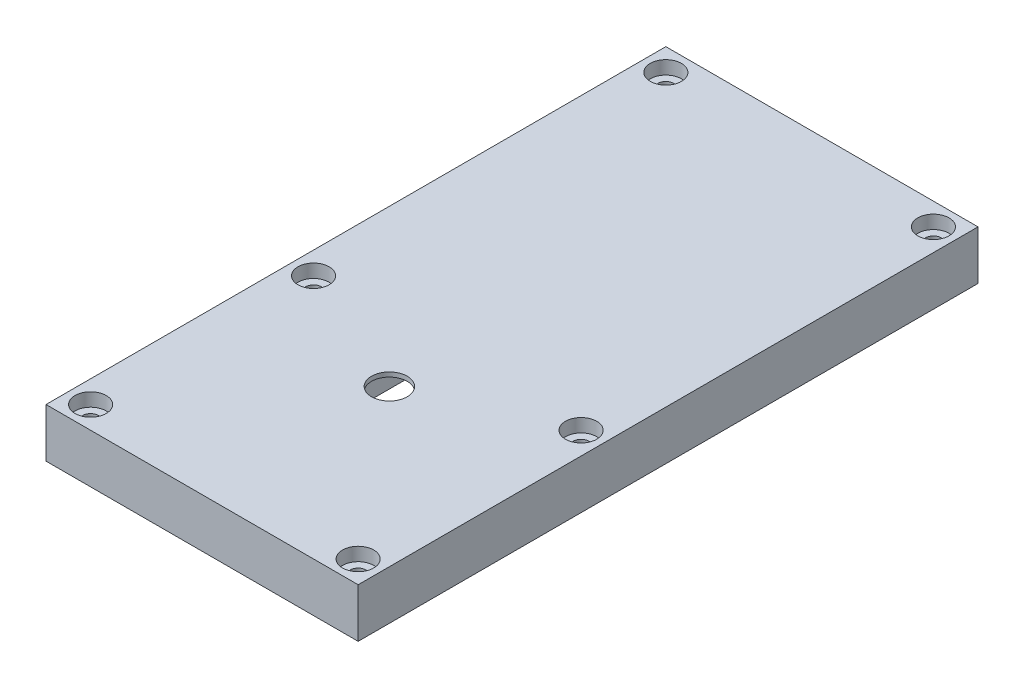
ISO-10303-21;
HEADER;
FILE_DESCRIPTION(('STEP AP214'),'2;1');
FILE_NAME('part.step','',(''),(''),'','','');
FILE_SCHEMA(('AUTOMOTIVE_DESIGN { 1 0 10303 214 1 1 1 1 }'));
ENDSEC;
DATA;
#1=APPLICATION_CONTEXT('core data for automotive mechanical design processes');
#2=APPLICATION_PROTOCOL_DEFINITION('international standard','automotive_design',2000,#1);
#3=PRODUCT_CONTEXT('',#1,'mechanical');
#4=PRODUCT('Part','Part','',(#3));
#5=PRODUCT_RELATED_PRODUCT_CATEGORY('part','',(#4));
#6=PRODUCT_DEFINITION_FORMATION('','',#4);
#7=PRODUCT_DEFINITION_CONTEXT('part definition',#1,'design');
#8=PRODUCT_DEFINITION('design','',#6,#7);
#9=PRODUCT_DEFINITION_SHAPE('','',#8);
#10=(LENGTH_UNIT() NAMED_UNIT(*) SI_UNIT(.MILLI.,.METRE.));
#11=(NAMED_UNIT(*) PLANE_ANGLE_UNIT() SI_UNIT($,.RADIAN.));
#12=(NAMED_UNIT(*) SI_UNIT($,.STERADIAN.) SOLID_ANGLE_UNIT());
#13=UNCERTAINTY_MEASURE_WITH_UNIT(LENGTH_MEASURE(1.E-05),#10,'distance_accuracy_value','');
#14=(GEOMETRIC_REPRESENTATION_CONTEXT(3) GLOBAL_UNCERTAINTY_ASSIGNED_CONTEXT((#13)) GLOBAL_UNIT_ASSIGNED_CONTEXT((#10,
#11,#12)) REPRESENTATION_CONTEXT('',''));
#15=CARTESIAN_POINT('',(0.,0.,0.));
#16=DIRECTION('',(0.,0.,1.));
#17=DIRECTION('',(1.,0.,0.));
#18=AXIS2_PLACEMENT_3D('',#15,#16,#17);
#19=CARTESIAN_POINT('',(-30.,0.,-64.5));
#20=DIRECTION('',(0.,1.,0.));
#21=DIRECTION('',(0.,0.,1.));
#22=AXIS2_PLACEMENT_3D('',#19,#20,#21);
#23=CYLINDRICAL_SURFACE('',#22,1.75);
#24=CARTESIAN_POINT('',(-30.,0.,-64.5));
#25=DIRECTION('',(0.,1.,0.));
#26=DIRECTION('',(0.,0.,1.));
#27=AXIS2_PLACEMENT_3D('',#24,#25,#26);
#28=CIRCLE('',#27,1.75);
#29=CARTESIAN_POINT('',(-30.,0.,-62.75));
#30=VERTEX_POINT('',#29);
#31=EDGE_CURVE('E211',#30,#30,#28,.T.);
#32=ORIENTED_EDGE('',*,*,#31,.F.);
#33=EDGE_LOOP('',(#32));
#34=FACE_BOUND('',#33,.T.);
#35=CARTESIAN_POINT('',(-30.,8.,-64.5));
#36=DIRECTION('',(0.,1.,0.));
#37=DIRECTION('',(0.,0.,1.));
#38=AXIS2_PLACEMENT_3D('',#35,#36,#37);
#39=CIRCLE('',#38,1.75);
#40=CARTESIAN_POINT('',(-30.,8.,-62.75));
#41=VERTEX_POINT('',#40);
#42=EDGE_CURVE('E39',#41,#41,#39,.F.);
#43=ORIENTED_EDGE('',*,*,#42,.F.);
#44=EDGE_LOOP('',(#43));
#45=FACE_BOUND('',#44,.T.);
#46=ADVANCED_FACE('F35',(#34,#45),#23,.F.);
#47=CARTESIAN_POINT('',(-30.,0.,64.5));
#48=DIRECTION('',(0.,1.,0.));
#49=DIRECTION('',(0.,0.,1.));
#50=AXIS2_PLACEMENT_3D('',#47,#48,#49);
#51=CYLINDRICAL_SURFACE('',#50,1.75);
#52=CARTESIAN_POINT('',(-30.,0.,64.5));
#53=DIRECTION('',(0.,1.,0.));
#54=DIRECTION('',(0.,0.,1.));
#55=AXIS2_PLACEMENT_3D('',#52,#53,#54);
#56=CIRCLE('',#55,1.75);
#57=CARTESIAN_POINT('',(-30.,0.,66.25));
#58=VERTEX_POINT('',#57);
#59=EDGE_CURVE('E198',#58,#58,#56,.T.);
#60=ORIENTED_EDGE('',*,*,#59,.F.);
#61=EDGE_LOOP('',(#60));
#62=FACE_BOUND('',#61,.T.);
#63=CARTESIAN_POINT('',(-30.,8.,64.5));
#64=DIRECTION('',(0.,1.,0.));
#65=DIRECTION('',(0.,0.,1.));
#66=AXIS2_PLACEMENT_3D('',#63,#64,#65);
#67=CIRCLE('',#66,1.75);
#68=CARTESIAN_POINT('',(-30.,8.,66.25));
#69=VERTEX_POINT('',#68);
#70=EDGE_CURVE('E260',#69,#69,#67,.F.);
#71=ORIENTED_EDGE('',*,*,#70,.F.);
#72=EDGE_LOOP('',(#71));
#73=FACE_BOUND('',#72,.T.);
#74=ADVANCED_FACE('F270',(#62,#73),#51,.F.);
#75=CARTESIAN_POINT('',(30.,0.,-64.5));
#76=DIRECTION('',(0.,1.,0.));
#77=DIRECTION('',(0.,0.,1.));
#78=AXIS2_PLACEMENT_3D('',#75,#76,#77);
#79=CYLINDRICAL_SURFACE('',#78,1.75);
#80=CARTESIAN_POINT('',(30.,0.,-64.5));
#81=DIRECTION('',(0.,1.,0.));
#82=DIRECTION('',(0.,0.,1.));
#83=AXIS2_PLACEMENT_3D('',#80,#81,#82);
#84=CIRCLE('',#83,1.75);
#85=CARTESIAN_POINT('',(30.,0.,-62.75));
#86=VERTEX_POINT('',#85);
#87=EDGE_CURVE('E208',#86,#86,#84,.T.);
#88=ORIENTED_EDGE('',*,*,#87,.F.);
#89=EDGE_LOOP('',(#88));
#90=FACE_BOUND('',#89,.T.);
#91=CARTESIAN_POINT('',(30.,8.,-64.5));
#92=DIRECTION('',(0.,1.,0.));
#93=DIRECTION('',(0.,0.,1.));
#94=AXIS2_PLACEMENT_3D('',#91,#92,#93);
#95=CIRCLE('',#94,1.75);
#96=CARTESIAN_POINT('',(30.,8.,-62.75));
#97=VERTEX_POINT('',#96);
#98=EDGE_CURVE('E258',#97,#97,#95,.F.);
#99=ORIENTED_EDGE('',*,*,#98,.F.);
#100=EDGE_LOOP('',(#99));
#101=FACE_BOUND('',#100,.T.);
#102=ADVANCED_FACE('F276',(#90,#101),#79,.F.);
#103=CARTESIAN_POINT('',(-30.,0.,14.5));
#104=DIRECTION('',(0.,1.,0.));
#105=DIRECTION('',(0.,0.,1.));
#106=AXIS2_PLACEMENT_3D('',#103,#104,#105);
#107=CYLINDRICAL_SURFACE('',#106,1.75000000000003);
#108=CARTESIAN_POINT('',(-30.,0.,14.5));
#109=DIRECTION('',(0.,1.,0.));
#110=DIRECTION('',(0.,0.,1.));
#111=AXIS2_PLACEMENT_3D('',#108,#109,#110);
#112=CIRCLE('',#111,1.75000000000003);
#113=CARTESIAN_POINT('',(-30.,0.,16.2500000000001));
#114=VERTEX_POINT('',#113);
#115=EDGE_CURVE('E205',#114,#114,#112,.T.);
#116=ORIENTED_EDGE('',*,*,#115,.F.);
#117=EDGE_LOOP('',(#116));
#118=FACE_BOUND('',#117,.T.);
#119=CARTESIAN_POINT('',(-30.,8.,14.5));
#120=DIRECTION('',(0.,1.,0.));
#121=DIRECTION('',(0.,0.,1.));
#122=AXIS2_PLACEMENT_3D('',#119,#120,#121);
#123=CIRCLE('',#122,1.75000000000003);
#124=CARTESIAN_POINT('',(-30.,8.,16.2500000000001));
#125=VERTEX_POINT('',#124);
#126=EDGE_CURVE('E255',#125,#125,#123,.F.);
#127=ORIENTED_EDGE('',*,*,#126,.F.);
#128=EDGE_LOOP('',(#127));
#129=FACE_BOUND('',#128,.T.);
#130=ADVANCED_FACE('F282',(#118,#129),#107,.F.);
#131=CARTESIAN_POINT('',(30.,0.,14.5));
#132=DIRECTION('',(0.,1.,0.));
#133=DIRECTION('',(0.,0.,1.));
#134=AXIS2_PLACEMENT_3D('',#131,#132,#133);
#135=CYLINDRICAL_SURFACE('',#134,1.75000000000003);
#136=CARTESIAN_POINT('',(30.,0.,14.5));
#137=DIRECTION('',(0.,1.,0.));
#138=DIRECTION('',(0.,0.,1.));
#139=AXIS2_PLACEMENT_3D('',#136,#137,#138);
#140=CIRCLE('',#139,1.75000000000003);
#141=CARTESIAN_POINT('',(30.,0.,16.2500000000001));
#142=VERTEX_POINT('',#141);
#143=EDGE_CURVE('E202',#142,#142,#140,.T.);
#144=ORIENTED_EDGE('',*,*,#143,.F.);
#145=EDGE_LOOP('',(#144));
#146=FACE_BOUND('',#145,.T.);
#147=CARTESIAN_POINT('',(30.,8.,14.5));
#148=DIRECTION('',(0.,1.,0.));
#149=DIRECTION('',(0.,0.,1.));
#150=AXIS2_PLACEMENT_3D('',#147,#148,#149);
#151=CIRCLE('',#150,1.75000000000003);
#152=CARTESIAN_POINT('',(30.,8.,16.2500000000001));
#153=VERTEX_POINT('',#152);
#154=EDGE_CURVE('E251',#153,#153,#151,.F.);
#155=ORIENTED_EDGE('',*,*,#154,.F.);
#156=EDGE_LOOP('',(#155));
#157=FACE_BOUND('',#156,.T.);
#158=ADVANCED_FACE('F355',(#146,#157),#135,.F.);
#159=CARTESIAN_POINT('',(30.,0.,64.5));
#160=DIRECTION('',(0.,1.,0.));
#161=DIRECTION('',(0.,0.,1.));
#162=AXIS2_PLACEMENT_3D('',#159,#160,#161);
#163=CYLINDRICAL_SURFACE('',#162,1.75);
#164=CARTESIAN_POINT('',(30.,0.,64.5));
#165=DIRECTION('',(0.,1.,0.));
#166=DIRECTION('',(0.,0.,1.));
#167=AXIS2_PLACEMENT_3D('',#164,#165,#166);
#168=CIRCLE('',#167,1.75);
#169=CARTESIAN_POINT('',(30.,0.,66.25));
#170=VERTEX_POINT('',#169);
#171=EDGE_CURVE('E201',#170,#170,#168,.T.);
#172=ORIENTED_EDGE('',*,*,#171,.F.);
#173=EDGE_LOOP('',(#172));
#174=FACE_BOUND('',#173,.T.);
#175=CARTESIAN_POINT('',(30.,8.,64.5));
#176=DIRECTION('',(0.,1.,0.));
#177=DIRECTION('',(0.,0.,1.));
#178=AXIS2_PLACEMENT_3D('',#175,#176,#177);
#179=CIRCLE('',#178,1.75);
#180=CARTESIAN_POINT('',(30.,8.,66.25));
#181=VERTEX_POINT('',#180);
#182=EDGE_CURVE('E248',#181,#181,#179,.F.);
#183=ORIENTED_EDGE('',*,*,#182,.F.);
#184=EDGE_LOOP('',(#183));
#185=FACE_BOUND('',#184,.T.);
#186=ADVANCED_FACE('F309',(#174,#185),#163,.F.);
#187=CARTESIAN_POINT('',(35.,11.,69.5));
#188=DIRECTION('',(-1.,0.,0.));
#189=DIRECTION('',(0.,0.,1.));
#190=AXIS2_PLACEMENT_3D('',#187,#188,#189);
#191=PLANE('',#190);
#192=DIRECTION('',(0.,0.,-1.));
#193=VECTOR('',#192,1.);
#194=CARTESIAN_POINT('',(35.,0.,69.5));
#195=LINE('',#194,#193);
#196=CARTESIAN_POINT('',(35.,0.,69.5));
#197=VERTEX_POINT('',#196);
#198=CARTESIAN_POINT('',(35.,0.,-69.5));
#199=VERTEX_POINT('',#198);
#200=EDGE_CURVE('E219',#197,#199,#195,.T.);
#201=ORIENTED_EDGE('',*,*,#200,.T.);
#202=DIRECTION('',(0.,-1.,0.));
#203=VECTOR('',#202,1.);
#204=CARTESIAN_POINT('',(35.,11.,-69.5));
#205=LINE('',#204,#203);
#206=CARTESIAN_POINT('',(35.,11.,-69.5));
#207=VERTEX_POINT('',#206);
#208=EDGE_CURVE('E11',#207,#199,#205,.T.);
#209=ORIENTED_EDGE('',*,*,#208,.F.);
#210=DIRECTION('',(0.,0.,-1.));
#211=VECTOR('',#210,1.);
#212=CARTESIAN_POINT('',(35.,11.,69.5));
#213=LINE('',#212,#211);
#214=CARTESIAN_POINT('',(35.,11.,69.5));
#215=VERTEX_POINT('',#214);
#216=EDGE_CURVE('E220',#215,#207,#213,.T.);
#217=ORIENTED_EDGE('',*,*,#216,.F.);
#218=DIRECTION('',(0.,-1.,0.));
#219=VECTOR('',#218,1.);
#220=CARTESIAN_POINT('',(35.,11.,69.5));
#221=LINE('',#220,#219);
#222=EDGE_CURVE('E230',#215,#197,#221,.T.);
#223=ORIENTED_EDGE('',*,*,#222,.T.);
#224=EDGE_LOOP('',(#201,#209,#217,#223));
#225=FACE_BOUND('',#224,.T.);
#226=ADVANCED_FACE('F37',(#225),#191,.F.);
#227=CARTESIAN_POINT('',(-35.,11.,-69.5));
#228=DIRECTION('',(0.,0.,1.));
#229=DIRECTION('',(1.,0.,0.));
#230=AXIS2_PLACEMENT_3D('',#227,#228,#229);
#231=PLANE('',#230);
#232=DIRECTION('',(-1.,0.,0.));
#233=VECTOR('',#232,1.);
#234=CARTESIAN_POINT('',(-35.,0.,-69.5));
#235=LINE('',#234,#233);
#236=CARTESIAN_POINT('',(10.25,0.,-69.5));
#237=VERTEX_POINT('',#236);
#238=EDGE_CURVE('E233',#199,#237,#235,.T.);
#239=ORIENTED_EDGE('',*,*,#238,.T.);
#240=DIRECTION('',(0.,1.,0.));
#241=VECTOR('',#240,1.);
#242=CARTESIAN_POINT('',(10.25,-12.75,-69.5));
#243=LINE('',#242,#241);
#244=CARTESIAN_POINT('',(10.25,-12.75,-69.5));
#245=VERTEX_POINT('',#244);
#246=EDGE_CURVE('E193',#245,#237,#243,.T.);
#247=ORIENTED_EDGE('',*,*,#246,.F.);
#248=DIRECTION('',(1.,0.,0.));
#249=VECTOR('',#248,1.);
#250=CARTESIAN_POINT('',(-10.25,-12.75,-69.5));
#251=LINE('',#250,#249);
#252=CARTESIAN_POINT('',(-10.25,-12.75,-69.5));
#253=VERTEX_POINT('',#252);
#254=EDGE_CURVE('E176',#253,#245,#251,.T.);
#255=ORIENTED_EDGE('',*,*,#254,.F.);
#256=DIRECTION('',(0.,1.,0.));
#257=VECTOR('',#256,1.);
#258=CARTESIAN_POINT('',(-10.25,-12.75,-69.5));
#259=LINE('',#258,#257);
#260=CARTESIAN_POINT('',(-10.25,0.,-69.5));
#261=VERTEX_POINT('',#260);
#262=EDGE_CURVE('E196',#253,#261,#259,.T.);
#263=ORIENTED_EDGE('',*,*,#262,.T.);
#264=CARTESIAN_POINT('',(-35.,0.,-69.5));
#265=VERTEX_POINT('',#264);
#266=EDGE_CURVE('E59',#261,#265,#235,.T.);
#267=ORIENTED_EDGE('',*,*,#266,.T.);
#268=DIRECTION('',(0.,-1.,0.));
#269=VECTOR('',#268,1.);
#270=CARTESIAN_POINT('',(-35.,11.,-69.5));
#271=LINE('',#270,#269);
#272=CARTESIAN_POINT('',(-35.,11.,-69.5));
#273=VERTEX_POINT('',#272);
#274=EDGE_CURVE('E44',#273,#265,#271,.T.);
#275=ORIENTED_EDGE('',*,*,#274,.F.);
#276=DIRECTION('',(-1.,0.,0.));
#277=VECTOR('',#276,1.);
#278=CARTESIAN_POINT('',(-35.,11.,-69.5));
#279=LINE('',#278,#277);
#280=EDGE_CURVE('E223',#207,#273,#279,.T.);
#281=ORIENTED_EDGE('',*,*,#280,.F.);
#282=ORIENTED_EDGE('',*,*,#208,.T.);
#283=EDGE_LOOP('',(#239,#247,#255,#263,#267,#275,#281,#282));
#284=FACE_BOUND('',#283,.T.);
#285=ADVANCED_FACE('F302',(#284),#231,.F.);
#286=CARTESIAN_POINT('',(-35.,11.,69.5));
#287=DIRECTION('',(1.,0.,0.));
#288=DIRECTION('',(0.,0.,-1.));
#289=AXIS2_PLACEMENT_3D('',#286,#287,#288);
#290=PLANE('',#289);
#291=DIRECTION('',(0.,0.,1.));
#292=VECTOR('',#291,1.);
#293=CARTESIAN_POINT('',(-35.,0.,69.5));
#294=LINE('',#293,#292);
#295=CARTESIAN_POINT('',(-35.,0.,69.5));
#296=VERTEX_POINT('',#295);
#297=EDGE_CURVE('E236',#265,#296,#294,.T.);
#298=ORIENTED_EDGE('',*,*,#297,.T.);
#299=DIRECTION('',(0.,-1.,0.));
#300=VECTOR('',#299,1.);
#301=CARTESIAN_POINT('',(-35.,11.,69.5));
#302=LINE('',#301,#300);
#303=CARTESIAN_POINT('',(-35.,11.,69.5));
#304=VERTEX_POINT('',#303);
#305=EDGE_CURVE('E241',#304,#296,#302,.T.);
#306=ORIENTED_EDGE('',*,*,#305,.F.);
#307=DIRECTION('',(0.,0.,1.));
#308=VECTOR('',#307,1.);
#309=CARTESIAN_POINT('',(-35.,11.,69.5));
#310=LINE('',#309,#308);
#311=EDGE_CURVE('E226',#273,#304,#310,.T.);
#312=ORIENTED_EDGE('',*,*,#311,.F.);
#313=ORIENTED_EDGE('',*,*,#274,.T.);
#314=EDGE_LOOP('',(#298,#306,#312,#313));
#315=FACE_BOUND('',#314,.T.);
#316=ADVANCED_FACE('F299',(#315),#290,.F.);
#317=CARTESIAN_POINT('',(-35.,11.,69.5));
#318=DIRECTION('',(0.,0.,-1.));
#319=DIRECTION('',(-1.,0.,0.));
#320=AXIS2_PLACEMENT_3D('',#317,#318,#319);
#321=PLANE('',#320);
#322=DIRECTION('',(1.,0.,0.));
#323=VECTOR('',#322,1.);
#324=CARTESIAN_POINT('',(-35.,0.,69.5));
#325=LINE('',#324,#323);
#326=EDGE_CURVE('E224',#296,#197,#325,.T.);
#327=ORIENTED_EDGE('',*,*,#326,.T.);
#328=ORIENTED_EDGE('',*,*,#222,.F.);
#329=DIRECTION('',(1.,0.,0.));
#330=VECTOR('',#329,1.);
#331=CARTESIAN_POINT('',(-35.,11.,69.5));
#332=LINE('',#331,#330);
#333=EDGE_CURVE('E228',#304,#215,#332,.T.);
#334=ORIENTED_EDGE('',*,*,#333,.F.);
#335=ORIENTED_EDGE('',*,*,#305,.T.);
#336=EDGE_LOOP('',(#327,#328,#334,#335));
#337=FACE_BOUND('',#336,.T.);
#338=ADVANCED_FACE('F293',(#337),#321,.F.);
#339=CARTESIAN_POINT('',(0.,11.,0.));
#340=DIRECTION('',(0.,-1.,0.));
#341=DIRECTION('',(0.,0.,-1.));
#342=AXIS2_PLACEMENT_3D('',#339,#340,#341);
#343=PLANE('',#342);
#344=CARTESIAN_POINT('',(-30.,11.,64.5));
#345=DIRECTION('',(0.,1.,0.));
#346=DIRECTION('',(0.,0.,1.));
#347=AXIS2_PLACEMENT_3D('',#344,#345,#346);
#348=CIRCLE('',#347,3.5);
#349=CARTESIAN_POINT('',(-30.,11.,68.));
#350=VERTEX_POINT('',#349);
#351=EDGE_CURVE('E554',#350,#350,#348,.T.);
#352=ORIENTED_EDGE('',*,*,#351,.F.);
#353=EDGE_LOOP('',(#352));
#354=FACE_BOUND('',#353,.T.);
#355=CARTESIAN_POINT('',(30.,11.,14.5));
#356=DIRECTION('',(0.,1.,0.));
#357=DIRECTION('',(0.,0.,1.));
#358=AXIS2_PLACEMENT_3D('',#355,#356,#357);
#359=CIRCLE('',#358,3.5);
#360=CARTESIAN_POINT('',(30.,11.,18.));
#361=VERTEX_POINT('',#360);
#362=EDGE_CURVE('E557',#361,#361,#359,.T.);
#363=ORIENTED_EDGE('',*,*,#362,.F.);
#364=EDGE_LOOP('',(#363));
#365=FACE_BOUND('',#364,.T.);
#366=CARTESIAN_POINT('',(-30.,11.,14.5));
#367=DIRECTION('',(0.,1.,0.));
#368=DIRECTION('',(0.,0.,1.));
#369=AXIS2_PLACEMENT_3D('',#366,#367,#368);
#370=CIRCLE('',#369,3.5);
#371=CARTESIAN_POINT('',(-30.,11.,18.));
#372=VERTEX_POINT('',#371);
#373=EDGE_CURVE('E572',#372,#372,#370,.T.);
#374=ORIENTED_EDGE('',*,*,#373,.F.);
#375=EDGE_LOOP('',(#374));
#376=FACE_BOUND('',#375,.T.);
#377=CARTESIAN_POINT('',(30.,11.,-64.5));
#378=DIRECTION('',(0.,1.,0.));
#379=DIRECTION('',(0.,0.,1.));
#380=AXIS2_PLACEMENT_3D('',#377,#378,#379);
#381=CIRCLE('',#380,3.5);
#382=CARTESIAN_POINT('',(30.,11.,-61.));
#383=VERTEX_POINT('',#382);
#384=EDGE_CURVE('E566',#383,#383,#381,.T.);
#385=ORIENTED_EDGE('',*,*,#384,.F.);
#386=EDGE_LOOP('',(#385));
#387=FACE_BOUND('',#386,.T.);
#388=CARTESIAN_POINT('',(30.,11.,64.5));
#389=DIRECTION('',(0.,1.,0.));
#390=DIRECTION('',(0.,0.,1.));
#391=AXIS2_PLACEMENT_3D('',#388,#389,#390);
#392=CIRCLE('',#391,3.5);
#393=CARTESIAN_POINT('',(30.,11.,68.));
#394=VERTEX_POINT('',#393);
#395=EDGE_CURVE('E560',#394,#394,#392,.T.);
#396=ORIENTED_EDGE('',*,*,#395,.F.);
#397=EDGE_LOOP('',(#396));
#398=FACE_BOUND('',#397,.T.);
#399=CARTESIAN_POINT('',(-30.,11.,-64.5));
#400=DIRECTION('',(0.,1.,0.));
#401=DIRECTION('',(0.,0.,1.));
#402=AXIS2_PLACEMENT_3D('',#399,#400,#401);
#403=CIRCLE('',#402,3.5);
#404=CARTESIAN_POINT('',(-30.,11.,-61.));
#405=VERTEX_POINT('',#404);
#406=EDGE_CURVE('E157',#405,#405,#403,.T.);
#407=ORIENTED_EDGE('',*,*,#406,.F.);
#408=EDGE_LOOP('',(#407));
#409=FACE_BOUND('',#408,.T.);
#410=CARTESIAN_POINT('',(0.,11.,27.5));
#411=DIRECTION('',(0.,1.,0.));
#412=DIRECTION('',(0.,0.,1.));
#413=AXIS2_PLACEMENT_3D('',#410,#411,#412);
#414=CIRCLE('',#413,4.);
#415=CARTESIAN_POINT('',(0.,11.,31.5));
#416=VERTEX_POINT('',#415);
#417=EDGE_CURVE('E216',#416,#416,#414,.T.);
#418=ORIENTED_EDGE('',*,*,#417,.F.);
#419=EDGE_LOOP('',(#418));
#420=FACE_BOUND('',#419,.T.);
#421=ORIENTED_EDGE('',*,*,#216,.T.);
#422=ORIENTED_EDGE('',*,*,#280,.T.);
#423=ORIENTED_EDGE('',*,*,#311,.T.);
#424=ORIENTED_EDGE('',*,*,#333,.T.);
#425=EDGE_LOOP('',(#421,#422,#423,#424));
#426=FACE_BOUND('',#425,.T.);
#427=ADVANCED_FACE('F290',(#354,#365,#376,#387,#398,#409,#420,#426),#343,.F.);
#428=CARTESIAN_POINT('',(0.,0.,0.));
#429=DIRECTION('',(0.,-1.,0.));
#430=DIRECTION('',(0.,0.,-1.));
#431=AXIS2_PLACEMENT_3D('',#428,#429,#430);
#432=PLANE('',#431);
#433=DIRECTION('',(1.,0.,0.));
#434=VECTOR('',#433,1.);
#435=CARTESIAN_POINT('',(-10.5,0.,-65.5));
#436=LINE('',#435,#434);
#437=CARTESIAN_POINT('',(-10.5,0.,-65.5));
#438=VERTEX_POINT('',#437);
#439=CARTESIAN_POINT('',(-10.25,0.,-65.5));
#440=VERTEX_POINT('',#439);
#441=EDGE_CURVE('E52',#438,#440,#436,.T.);
#442=ORIENTED_EDGE('',*,*,#441,.F.);
#443=DIRECTION('',(0.,0.,-1.));
#444=VECTOR('',#443,1.);
#445=CARTESIAN_POINT('',(-10.5,0.,-65.5));
#446=LINE('',#445,#444);
#447=CARTESIAN_POINT('',(-10.5,0.,37.5));
#448=VERTEX_POINT('',#447);
#449=EDGE_CURVE('E134',#448,#438,#446,.T.);
#450=ORIENTED_EDGE('',*,*,#449,.F.);
#451=DIRECTION('',(-1.,0.,0.));
#452=VECTOR('',#451,1.);
#453=CARTESIAN_POINT('',(-10.5,0.,37.5));
#454=LINE('',#453,#452);
#455=CARTESIAN_POINT('',(10.5,0.,37.5));
#456=VERTEX_POINT('',#455);
#457=EDGE_CURVE('E151',#456,#448,#454,.T.);
#458=ORIENTED_EDGE('',*,*,#457,.F.);
#459=DIRECTION('',(0.,0.,1.));
#460=VECTOR('',#459,1.);
#461=CARTESIAN_POINT('',(10.5,0.,37.5));
#462=LINE('',#461,#460);
#463=CARTESIAN_POINT('',(10.5,0.,-65.5));
#464=VERTEX_POINT('',#463);
#465=EDGE_CURVE('E154',#464,#456,#462,.T.);
#466=ORIENTED_EDGE('',*,*,#465,.F.);
#467=CARTESIAN_POINT('',(10.25,0.,-65.5));
#468=VERTEX_POINT('',#467);
#469=EDGE_CURVE('E163',#468,#464,#436,.T.);
#470=ORIENTED_EDGE('',*,*,#469,.F.);
#471=DIRECTION('',(0.,0.,1.));
#472=VECTOR('',#471,1.);
#473=CARTESIAN_POINT('',(10.25,0.,-65.5));
#474=LINE('',#473,#472);
#475=EDGE_CURVE('E177',#237,#468,#474,.T.);
#476=ORIENTED_EDGE('',*,*,#475,.F.);
#477=ORIENTED_EDGE('',*,*,#238,.F.);
#478=ORIENTED_EDGE('',*,*,#200,.F.);
#479=ORIENTED_EDGE('',*,*,#326,.F.);
#480=ORIENTED_EDGE('',*,*,#297,.F.);
#481=ORIENTED_EDGE('',*,*,#266,.F.);
#482=DIRECTION('',(0.,0.,-1.));
#483=VECTOR('',#482,1.);
#484=CARTESIAN_POINT('',(-10.25,0.,-65.5));
#485=LINE('',#484,#483);
#486=EDGE_CURVE('E184',#440,#261,#485,.T.);
#487=ORIENTED_EDGE('',*,*,#486,.F.);
#488=EDGE_LOOP('',(#442,#450,#458,#466,#470,#476,#477,#478,#479,#480,#481,#487));
#489=FACE_BOUND('',#488,.T.);
#490=ORIENTED_EDGE('',*,*,#171,.T.);
#491=EDGE_LOOP('',(#490));
#492=FACE_BOUND('',#491,.T.);
#493=ORIENTED_EDGE('',*,*,#143,.T.);
#494=EDGE_LOOP('',(#493));
#495=FACE_BOUND('',#494,.T.);
#496=ORIENTED_EDGE('',*,*,#115,.T.);
#497=EDGE_LOOP('',(#496));
#498=FACE_BOUND('',#497,.T.);
#499=ORIENTED_EDGE('',*,*,#87,.T.);
#500=EDGE_LOOP('',(#499));
#501=FACE_BOUND('',#500,.T.);
#502=ORIENTED_EDGE('',*,*,#59,.T.);
#503=EDGE_LOOP('',(#502));
#504=FACE_BOUND('',#503,.T.);
#505=ORIENTED_EDGE('',*,*,#31,.T.);
#506=EDGE_LOOP('',(#505));
#507=FACE_BOUND('',#506,.T.);
#508=ADVANCED_FACE('F288',(#489,#492,#495,#498,#501,#504,#507),#432,.T.);
#509=CARTESIAN_POINT('',(0.,0.999999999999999,27.5));
#510=DIRECTION('',(0.,1.,0.));
#511=DIRECTION('',(0.,0.,1.));
#512=AXIS2_PLACEMENT_3D('',#509,#510,#511);
#513=CYLINDRICAL_SURFACE('',#512,4.);
#514=CARTESIAN_POINT('',(0.,10.,27.5));
#515=DIRECTION('',(0.,1.,0.));
#516=DIRECTION('',(0.,0.,1.));
#517=AXIS2_PLACEMENT_3D('',#514,#515,#516);
#518=CIRCLE('',#517,4.);
#519=CARTESIAN_POINT('',(0.,10.,31.5));
#520=VERTEX_POINT('',#519);
#521=EDGE_CURVE('E169',#520,#520,#518,.F.);
#522=ORIENTED_EDGE('',*,*,#521,.T.);
#523=EDGE_LOOP('',(#522));
#524=FACE_BOUND('',#523,.T.);
#525=ORIENTED_EDGE('',*,*,#417,.T.);
#526=EDGE_LOOP('',(#525));
#527=FACE_BOUND('',#526,.T.);
#528=ADVANCED_FACE('F284',(#524,#527),#513,.F.);
#529=CARTESIAN_POINT('',(-10.25,-12.75,-65.5));
#530=DIRECTION('',(1.,0.,0.));
#531=DIRECTION('',(0.,0.,-1.));
#532=AXIS2_PLACEMENT_3D('',#529,#530,#531);
#533=PLANE('',#532);
#534=ORIENTED_EDGE('',*,*,#486,.T.);
#535=ORIENTED_EDGE('',*,*,#262,.F.);
#536=DIRECTION('',(0.,0.,-1.));
#537=VECTOR('',#536,1.);
#538=CARTESIAN_POINT('',(-10.25,-12.75,-65.5));
#539=LINE('',#538,#537);
#540=CARTESIAN_POINT('',(-10.25,-12.75,-65.5));
#541=VERTEX_POINT('',#540);
#542=EDGE_CURVE('E173',#541,#253,#539,.T.);
#543=ORIENTED_EDGE('',*,*,#542,.F.);
#544=DIRECTION('',(0.,1.,0.));
#545=VECTOR('',#544,1.);
#546=CARTESIAN_POINT('',(-10.25,-12.75,-65.5));
#547=LINE('',#546,#545);
#548=EDGE_CURVE('E183',#541,#440,#547,.T.);
#549=ORIENTED_EDGE('',*,*,#548,.T.);
#550=EDGE_LOOP('',(#534,#535,#543,#549));
#551=FACE_BOUND('',#550,.T.);
#552=ADVANCED_FACE('F287',(#551),#533,.F.);
#553=CARTESIAN_POINT('',(10.25,-12.75,-65.5));
#554=DIRECTION('',(-1.,0.,0.));
#555=DIRECTION('',(0.,0.,1.));
#556=AXIS2_PLACEMENT_3D('',#553,#554,#555);
#557=PLANE('',#556);
#558=ORIENTED_EDGE('',*,*,#475,.T.);
#559=DIRECTION('',(0.,1.,0.));
#560=VECTOR('',#559,1.);
#561=CARTESIAN_POINT('',(10.25,-12.75,-65.5));
#562=LINE('',#561,#560);
#563=CARTESIAN_POINT('',(10.25,-12.75,-65.5));
#564=VERTEX_POINT('',#563);
#565=EDGE_CURVE('E191',#564,#468,#562,.T.);
#566=ORIENTED_EDGE('',*,*,#565,.F.);
#567=DIRECTION('',(0.,0.,1.));
#568=VECTOR('',#567,1.);
#569=CARTESIAN_POINT('',(10.25,-12.75,-65.5));
#570=LINE('',#569,#568);
#571=EDGE_CURVE('E179',#245,#564,#570,.T.);
#572=ORIENTED_EDGE('',*,*,#571,.F.);
#573=ORIENTED_EDGE('',*,*,#246,.T.);
#574=EDGE_LOOP('',(#558,#566,#572,#573));
#575=FACE_BOUND('',#574,.T.);
#576=ADVANCED_FACE('F316',(#575),#557,.F.);
#577=CARTESIAN_POINT('',(-10.25,-12.75,-65.5));
#578=DIRECTION('',(0.,0.,-1.));
#579=DIRECTION('',(-1.,0.,0.));
#580=AXIS2_PLACEMENT_3D('',#577,#578,#579);
#581=PLANE('',#580);
#582=ORIENTED_EDGE('',*,*,#565,.T.);
#583=ORIENTED_EDGE('',*,*,#469,.T.);
#584=DIRECTION('',(0.,-1.,0.));
#585=VECTOR('',#584,1.);
#586=CARTESIAN_POINT('',(10.5,10.,-65.5));
#587=LINE('',#586,#585);
#588=CARTESIAN_POINT('',(10.5,10.,-65.5));
#589=VERTEX_POINT('',#588);
#590=EDGE_CURVE('E135',#589,#464,#587,.T.);
#591=ORIENTED_EDGE('',*,*,#590,.F.);
#592=DIRECTION('',(1.,0.,0.));
#593=VECTOR('',#592,1.);
#594=CARTESIAN_POINT('',(-10.5,10.,-65.5));
#595=LINE('',#594,#593);
#596=CARTESIAN_POINT('',(-10.5,10.,-65.5));
#597=VERTEX_POINT('',#596);
#598=EDGE_CURVE('E139',#597,#589,#595,.T.);
#599=ORIENTED_EDGE('',*,*,#598,.F.);
#600=DIRECTION('',(0.,-1.,0.));
#601=VECTOR('',#600,1.);
#602=CARTESIAN_POINT('',(-10.5,10.,-65.5));
#603=LINE('',#602,#601);
#604=EDGE_CURVE('E127',#597,#438,#603,.T.);
#605=ORIENTED_EDGE('',*,*,#604,.T.);
#606=ORIENTED_EDGE('',*,*,#441,.T.);
#607=ORIENTED_EDGE('',*,*,#548,.F.);
#608=DIRECTION('',(-1.,0.,0.));
#609=VECTOR('',#608,1.);
#610=CARTESIAN_POINT('',(-10.25,-12.75,-65.5));
#611=LINE('',#610,#609);
#612=EDGE_CURVE('E181',#564,#541,#611,.T.);
#613=ORIENTED_EDGE('',*,*,#612,.F.);
#614=EDGE_LOOP('',(#582,#583,#591,#599,#605,#606,#607,#613));
#615=FACE_BOUND('',#614,.T.);
#616=ADVANCED_FACE('F141',(#615),#581,.F.);
#617=CARTESIAN_POINT('',(0.,-12.75,0.));
#618=DIRECTION('',(0.,-1.,0.));
#619=DIRECTION('',(0.,0.,-1.));
#620=AXIS2_PLACEMENT_3D('',#617,#618,#619);
#621=PLANE('',#620);
#622=ORIENTED_EDGE('',*,*,#542,.T.);
#623=ORIENTED_EDGE('',*,*,#254,.T.);
#624=ORIENTED_EDGE('',*,*,#571,.T.);
#625=ORIENTED_EDGE('',*,*,#612,.T.);
#626=EDGE_LOOP('',(#622,#623,#624,#625));
#627=FACE_BOUND('',#626,.T.);
#628=ADVANCED_FACE('F320',(#627),#621,.T.);
#629=CARTESIAN_POINT('',(0.,10.,0.));
#630=DIRECTION('',(0.,1.,0.));
#631=DIRECTION('',(0.,0.,1.));
#632=AXIS2_PLACEMENT_3D('',#629,#630,#631);
#633=PLANE('',#632);
#634=DIRECTION('',(0.,0.,-1.));
#635=VECTOR('',#634,1.);
#636=CARTESIAN_POINT('',(-10.5,10.,-65.5));
#637=LINE('',#636,#635);
#638=CARTESIAN_POINT('',(-10.5,10.,37.5));
#639=VERTEX_POINT('',#638);
#640=EDGE_CURVE('E131',#639,#597,#637,.T.);
#641=ORIENTED_EDGE('',*,*,#640,.T.);
#642=ORIENTED_EDGE('',*,*,#598,.T.);
#643=DIRECTION('',(0.,0.,1.));
#644=VECTOR('',#643,1.);
#645=CARTESIAN_POINT('',(10.5,10.,37.5));
#646=LINE('',#645,#644);
#647=CARTESIAN_POINT('',(10.5,10.,37.5));
#648=VERTEX_POINT('',#647);
#649=EDGE_CURVE('E146',#589,#648,#646,.T.);
#650=ORIENTED_EDGE('',*,*,#649,.T.);
#651=DIRECTION('',(-1.,0.,0.));
#652=VECTOR('',#651,1.);
#653=CARTESIAN_POINT('',(-10.5,10.,37.5));
#654=LINE('',#653,#652);
#655=EDGE_CURVE('E136',#648,#639,#654,.T.);
#656=ORIENTED_EDGE('',*,*,#655,.T.);
#657=EDGE_LOOP('',(#641,#642,#650,#656));
#658=FACE_BOUND('',#657,.T.);
#659=ORIENTED_EDGE('',*,*,#521,.F.);
#660=EDGE_LOOP('',(#659));
#661=FACE_BOUND('',#660,.T.);
#662=ADVANCED_FACE('F148',(#658,#661),#633,.F.);
#663=CARTESIAN_POINT('',(-10.5,10.,-65.5));
#664=DIRECTION('',(-1.,0.,0.));
#665=DIRECTION('',(0.,0.,1.));
#666=AXIS2_PLACEMENT_3D('',#663,#664,#665);
#667=PLANE('',#666);
#668=ORIENTED_EDGE('',*,*,#449,.T.);
#669=ORIENTED_EDGE('',*,*,#604,.F.);
#670=ORIENTED_EDGE('',*,*,#640,.F.);
#671=DIRECTION('',(0.,-1.,0.));
#672=VECTOR('',#671,1.);
#673=CARTESIAN_POINT('',(-10.5,10.,37.5));
#674=LINE('',#673,#672);
#675=EDGE_CURVE('E167',#639,#448,#674,.T.);
#676=ORIENTED_EDGE('',*,*,#675,.T.);
#677=EDGE_LOOP('',(#668,#669,#670,#676));
#678=FACE_BOUND('',#677,.T.);
#679=ADVANCED_FACE('F129',(#678),#667,.F.);
#680=CARTESIAN_POINT('',(-10.5,10.,37.5));
#681=DIRECTION('',(0.,0.,1.));
#682=DIRECTION('',(1.,0.,0.));
#683=AXIS2_PLACEMENT_3D('',#680,#681,#682);
#684=PLANE('',#683);
#685=ORIENTED_EDGE('',*,*,#457,.T.);
#686=ORIENTED_EDGE('',*,*,#675,.F.);
#687=ORIENTED_EDGE('',*,*,#655,.F.);
#688=DIRECTION('',(0.,-1.,0.));
#689=VECTOR('',#688,1.);
#690=CARTESIAN_POINT('',(10.5,10.,37.5));
#691=LINE('',#690,#689);
#692=EDGE_CURVE('E170',#648,#456,#691,.T.);
#693=ORIENTED_EDGE('',*,*,#692,.T.);
#694=EDGE_LOOP('',(#685,#686,#687,#693));
#695=FACE_BOUND('',#694,.T.);
#696=ADVANCED_FACE('F329',(#695),#684,.F.);
#697=CARTESIAN_POINT('',(10.5,10.,37.5));
#698=DIRECTION('',(1.,0.,0.));
#699=DIRECTION('',(0.,0.,-1.));
#700=AXIS2_PLACEMENT_3D('',#697,#698,#699);
#701=PLANE('',#700);
#702=ORIENTED_EDGE('',*,*,#465,.T.);
#703=ORIENTED_EDGE('',*,*,#692,.F.);
#704=ORIENTED_EDGE('',*,*,#649,.F.);
#705=ORIENTED_EDGE('',*,*,#590,.T.);
#706=EDGE_LOOP('',(#702,#703,#704,#705));
#707=FACE_BOUND('',#706,.T.);
#708=ADVANCED_FACE('F331',(#707),#701,.F.);
#709=CARTESIAN_POINT('',(30.,8.,64.5));
#710=DIRECTION('',(0.,1.,0.));
#711=DIRECTION('',(0.,0.,1.));
#712=AXIS2_PLACEMENT_3D('',#709,#710,#711);
#713=PLANE('',#712);
#714=CARTESIAN_POINT('',(30.,8.,64.5));
#715=DIRECTION('',(0.,1.,0.));
#716=DIRECTION('',(0.,0.,1.));
#717=AXIS2_PLACEMENT_3D('',#714,#715,#716);
#718=CIRCLE('',#717,3.5);
#719=CARTESIAN_POINT('',(30.,8.,68.));
#720=VERTEX_POINT('',#719);
#721=EDGE_CURVE('E555',#720,#720,#718,.T.);
#722=ORIENTED_EDGE('',*,*,#721,.T.);
#723=EDGE_LOOP('',(#722));
#724=FACE_BOUND('',#723,.T.);
#725=ORIENTED_EDGE('',*,*,#182,.T.);
#726=EDGE_LOOP('',(#725));
#727=FACE_BOUND('',#726,.T.);
#728=ADVANCED_FACE('F333',(#724,#727),#713,.T.);
#729=CARTESIAN_POINT('',(30.,8.,64.5));
#730=DIRECTION('',(0.,1.,0.));
#731=DIRECTION('',(0.,0.,1.));
#732=AXIS2_PLACEMENT_3D('',#729,#730,#731);
#733=CYLINDRICAL_SURFACE('',#732,3.5);
#734=ORIENTED_EDGE('',*,*,#721,.F.);
#735=EDGE_LOOP('',(#734));
#736=FACE_BOUND('',#735,.T.);
#737=ORIENTED_EDGE('',*,*,#395,.T.);
#738=EDGE_LOOP('',(#737));
#739=FACE_BOUND('',#738,.T.);
#740=ADVANCED_FACE('F339',(#736,#739),#733,.F.);
#741=CARTESIAN_POINT('',(30.,8.,14.5));
#742=DIRECTION('',(0.,1.,0.));
#743=DIRECTION('',(0.,0.,1.));
#744=AXIS2_PLACEMENT_3D('',#741,#742,#743);
#745=PLANE('',#744);
#746=CARTESIAN_POINT('',(30.,8.,14.5));
#747=DIRECTION('',(0.,1.,0.));
#748=DIRECTION('',(0.,0.,1.));
#749=AXIS2_PLACEMENT_3D('',#746,#747,#748);
#750=CIRCLE('',#749,3.5);
#751=CARTESIAN_POINT('',(30.,8.,18.));
#752=VERTEX_POINT('',#751);
#753=EDGE_CURVE('E574',#752,#752,#750,.T.);
#754=ORIENTED_EDGE('',*,*,#753,.T.);
#755=EDGE_LOOP('',(#754));
#756=FACE_BOUND('',#755,.T.);
#757=ORIENTED_EDGE('',*,*,#154,.T.);
#758=EDGE_LOOP('',(#757));
#759=FACE_BOUND('',#758,.T.);
#760=ADVANCED_FACE('F475',(#756,#759),#745,.T.);
#761=CARTESIAN_POINT('',(30.,8.,14.5));
#762=DIRECTION('',(0.,1.,0.));
#763=DIRECTION('',(0.,0.,1.));
#764=AXIS2_PLACEMENT_3D('',#761,#762,#763);
#765=CYLINDRICAL_SURFACE('',#764,3.5);
#766=ORIENTED_EDGE('',*,*,#753,.F.);
#767=EDGE_LOOP('',(#766));
#768=FACE_BOUND('',#767,.T.);
#769=ORIENTED_EDGE('',*,*,#362,.T.);
#770=EDGE_LOOP('',(#769));
#771=FACE_BOUND('',#770,.T.);
#772=ADVANCED_FACE('F393',(#768,#771),#765,.F.);
#773=CARTESIAN_POINT('',(-30.,8.,14.5));
#774=DIRECTION('',(0.,1.,0.));
#775=DIRECTION('',(0.,0.,1.));
#776=AXIS2_PLACEMENT_3D('',#773,#774,#775);
#777=PLANE('',#776);
#778=CARTESIAN_POINT('',(-30.,8.,14.5));
#779=DIRECTION('',(0.,1.,0.));
#780=DIRECTION('',(0.,0.,1.));
#781=AXIS2_PLACEMENT_3D('',#778,#779,#780);
#782=CIRCLE('',#781,3.5);
#783=CARTESIAN_POINT('',(-30.,8.,18.));
#784=VERTEX_POINT('',#783);
#785=EDGE_CURVE('E569',#784,#784,#782,.T.);
#786=ORIENTED_EDGE('',*,*,#785,.T.);
#787=EDGE_LOOP('',(#786));
#788=FACE_BOUND('',#787,.T.);
#789=ORIENTED_EDGE('',*,*,#126,.T.);
#790=EDGE_LOOP('',(#789));
#791=FACE_BOUND('',#790,.T.);
#792=ADVANCED_FACE('F384',(#788,#791),#777,.T.);
#793=CARTESIAN_POINT('',(-30.,8.,14.5));
#794=DIRECTION('',(0.,1.,0.));
#795=DIRECTION('',(0.,0.,1.));
#796=AXIS2_PLACEMENT_3D('',#793,#794,#795);
#797=CYLINDRICAL_SURFACE('',#796,3.5);
#798=ORIENTED_EDGE('',*,*,#785,.F.);
#799=EDGE_LOOP('',(#798));
#800=FACE_BOUND('',#799,.T.);
#801=ORIENTED_EDGE('',*,*,#373,.T.);
#802=EDGE_LOOP('',(#801));
#803=FACE_BOUND('',#802,.T.);
#804=ADVANCED_FACE('F374',(#800,#803),#797,.F.);
#805=CARTESIAN_POINT('',(30.,8.,-64.5));
#806=DIRECTION('',(0.,1.,0.));
#807=DIRECTION('',(0.,0.,1.));
#808=AXIS2_PLACEMENT_3D('',#805,#806,#807);
#809=PLANE('',#808);
#810=CARTESIAN_POINT('',(30.,8.,-64.5));
#811=DIRECTION('',(0.,1.,0.));
#812=DIRECTION('',(0.,0.,1.));
#813=AXIS2_PLACEMENT_3D('',#810,#811,#812);
#814=CIRCLE('',#813,3.5);
#815=CARTESIAN_POINT('',(30.,8.,-61.));
#816=VERTEX_POINT('',#815);
#817=EDGE_CURVE('E564',#816,#816,#814,.T.);
#818=ORIENTED_EDGE('',*,*,#817,.T.);
#819=EDGE_LOOP('',(#818));
#820=FACE_BOUND('',#819,.T.);
#821=ORIENTED_EDGE('',*,*,#98,.T.);
#822=EDGE_LOOP('',(#821));
#823=FACE_BOUND('',#822,.T.);
#824=ADVANCED_FACE('F371',(#820,#823),#809,.T.);
#825=CARTESIAN_POINT('',(30.,8.,-64.5));
#826=DIRECTION('',(0.,1.,0.));
#827=DIRECTION('',(0.,0.,1.));
#828=AXIS2_PLACEMENT_3D('',#825,#826,#827);
#829=CYLINDRICAL_SURFACE('',#828,3.5);
#830=ORIENTED_EDGE('',*,*,#817,.F.);
#831=EDGE_LOOP('',(#830));
#832=FACE_BOUND('',#831,.T.);
#833=ORIENTED_EDGE('',*,*,#384,.T.);
#834=EDGE_LOOP('',(#833));
#835=FACE_BOUND('',#834,.T.);
#836=ADVANCED_FACE('F373',(#832,#835),#829,.F.);
#837=CARTESIAN_POINT('',(-30.,8.,64.5));
#838=DIRECTION('',(0.,1.,0.));
#839=DIRECTION('',(0.,0.,1.));
#840=AXIS2_PLACEMENT_3D('',#837,#838,#839);
#841=PLANE('',#840);
#842=CARTESIAN_POINT('',(-30.,8.,64.5));
#843=DIRECTION('',(0.,1.,0.));
#844=DIRECTION('',(0.,0.,1.));
#845=AXIS2_PLACEMENT_3D('',#842,#843,#844);
#846=CIRCLE('',#845,3.5);
#847=CARTESIAN_POINT('',(-30.,8.,68.));
#848=VERTEX_POINT('',#847);
#849=EDGE_CURVE('E551',#848,#848,#846,.T.);
#850=ORIENTED_EDGE('',*,*,#849,.T.);
#851=EDGE_LOOP('',(#850));
#852=FACE_BOUND('',#851,.T.);
#853=ORIENTED_EDGE('',*,*,#70,.T.);
#854=EDGE_LOOP('',(#853));
#855=FACE_BOUND('',#854,.T.);
#856=ADVANCED_FACE('F381',(#852,#855),#841,.T.);
#857=CARTESIAN_POINT('',(-30.,8.,64.5));
#858=DIRECTION('',(0.,1.,0.));
#859=DIRECTION('',(0.,0.,1.));
#860=AXIS2_PLACEMENT_3D('',#857,#858,#859);
#861=CYLINDRICAL_SURFACE('',#860,3.5);
#862=ORIENTED_EDGE('',*,*,#849,.F.);
#863=EDGE_LOOP('',(#862));
#864=FACE_BOUND('',#863,.T.);
#865=ORIENTED_EDGE('',*,*,#351,.T.);
#866=EDGE_LOOP('',(#865));
#867=FACE_BOUND('',#866,.T.);
#868=ADVANCED_FACE('F389',(#864,#867),#861,.F.);
#869=CARTESIAN_POINT('',(-30.,8.,-64.5));
#870=DIRECTION('',(0.,1.,0.));
#871=DIRECTION('',(0.,0.,1.));
#872=AXIS2_PLACEMENT_3D('',#869,#870,#871);
#873=PLANE('',#872);
#874=CARTESIAN_POINT('',(-30.,8.,-64.5));
#875=DIRECTION('',(0.,1.,0.));
#876=DIRECTION('',(0.,0.,1.));
#877=AXIS2_PLACEMENT_3D('',#874,#875,#876);
#878=CIRCLE('',#877,3.5);
#879=CARTESIAN_POINT('',(-30.,8.,-61.));
#880=VERTEX_POINT('',#879);
#881=EDGE_CURVE('E252',#880,#880,#878,.T.);
#882=ORIENTED_EDGE('',*,*,#881,.T.);
#883=EDGE_LOOP('',(#882));
#884=FACE_BOUND('',#883,.T.);
#885=ORIENTED_EDGE('',*,*,#42,.T.);
#886=EDGE_LOOP('',(#885));
#887=FACE_BOUND('',#886,.T.);
#888=ADVANCED_FACE('F267',(#884,#887),#873,.T.);
#889=CARTESIAN_POINT('',(-30.,8.,-64.5));
#890=DIRECTION('',(0.,1.,0.));
#891=DIRECTION('',(0.,0.,1.));
#892=AXIS2_PLACEMENT_3D('',#889,#890,#891);
#893=CYLINDRICAL_SURFACE('',#892,3.5);
#894=ORIENTED_EDGE('',*,*,#881,.F.);
#895=EDGE_LOOP('',(#894));
#896=FACE_BOUND('',#895,.T.);
#897=ORIENTED_EDGE('',*,*,#406,.T.);
#898=EDGE_LOOP('',(#897));
#899=FACE_BOUND('',#898,.T.);
#900=ADVANCED_FACE('F398',(#896,#899),#893,.F.);
#901=CLOSED_SHELL('',(#46,#74,#102,#130,#158,#186,#226,#285,#316,#338,#427,#508,#528,#552,#576,
#616,#628,#662,#679,#696,#708,#728,#740,#760,#772,#792,#804,#824,#836,#856,#868,#888,#900));
#902=MANIFOLD_SOLID_BREP('B2',#901);
#903=ADVANCED_BREP_SHAPE_REPRESENTATION('',(#18,#902),#14);
#904=SHAPE_DEFINITION_REPRESENTATION(#9,#903);
ENDSEC;
END-ISO-10303-21;
